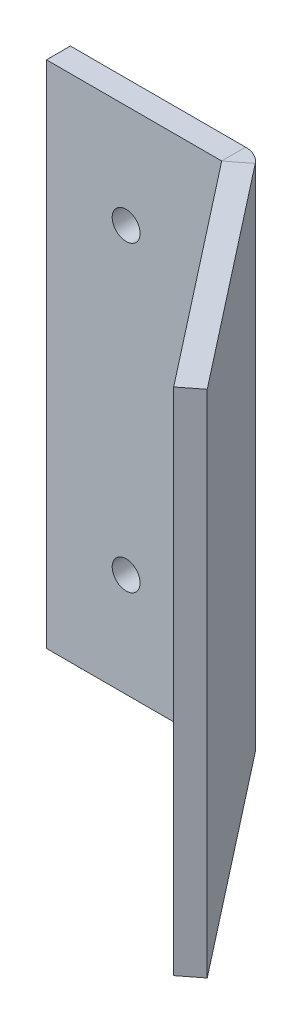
ISO-10303-21;
HEADER;
FILE_DESCRIPTION(('STEP AP214'),'2;1');
FILE_NAME('part.step','',(''),(''),'','','');
FILE_SCHEMA(('AUTOMOTIVE_DESIGN { 1 0 10303 214 1 1 1 1 }'));
ENDSEC;
DATA;
#1=APPLICATION_CONTEXT('core data for automotive mechanical design processes');
#2=APPLICATION_PROTOCOL_DEFINITION('international standard','automotive_design',2000,#1);
#3=PRODUCT_CONTEXT('',#1,'mechanical');
#4=PRODUCT('Part','Part','',(#3));
#5=PRODUCT_RELATED_PRODUCT_CATEGORY('part','',(#4));
#6=PRODUCT_DEFINITION_FORMATION('','',#4);
#7=PRODUCT_DEFINITION_CONTEXT('part definition',#1,'design');
#8=PRODUCT_DEFINITION('design','',#6,#7);
#9=PRODUCT_DEFINITION_SHAPE('','',#8);
#10=(LENGTH_UNIT() NAMED_UNIT(*) SI_UNIT(.MILLI.,.METRE.));
#11=(NAMED_UNIT(*) PLANE_ANGLE_UNIT() SI_UNIT($,.RADIAN.));
#12=(NAMED_UNIT(*) SI_UNIT($,.STERADIAN.) SOLID_ANGLE_UNIT());
#13=UNCERTAINTY_MEASURE_WITH_UNIT(LENGTH_MEASURE(1.E-05),#10,'distance_accuracy_value','');
#14=(GEOMETRIC_REPRESENTATION_CONTEXT(3) GLOBAL_UNCERTAINTY_ASSIGNED_CONTEXT((#13)) GLOBAL_UNIT_ASSIGNED_CONTEXT((#10,
#11,#12)) REPRESENTATION_CONTEXT('',''));
#15=CARTESIAN_POINT('',(0.,0.,0.));
#16=DIRECTION('',(0.,0.,1.));
#17=DIRECTION('',(1.,0.,0.));
#18=AXIS2_PLACEMENT_3D('',#15,#16,#17);
#19=CARTESIAN_POINT('',(8.45597401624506,64.,-14.3359798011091));
#20=DIRECTION('',(0.,-1.,0.));
#21=DIRECTION('',(0.788010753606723,0.,-0.615661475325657));
#22=AXIS2_PLACEMENT_3D('',#19,#20,#21);
#23=PLANE('',#22);
#24=DIRECTION('',(-0.615661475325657,0.,-0.788010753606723));
#25=VECTOR('',#24,1.);
#26=CARTESIAN_POINT('',(10.8200062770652,64.,-16.1829642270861));
#27=LINE('',#26,#25);
#28=CARTESIAN_POINT('',(45.9127103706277,64.,28.7336487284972));
#29=VERTEX_POINT('',#28);
#30=CARTESIAN_POINT('',(24.3673608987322,64.,1.15685895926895));
#31=VERTEX_POINT('',#30);
#32=EDGE_CURVE('E85',#29,#31,#27,.T.);
#33=ORIENTED_EDGE('',*,*,#32,.T.);
#34=DIRECTION('',(-0.788010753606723,0.,0.615661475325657));
#35=VECTOR('',#34,1.);
#36=CARTESIAN_POINT('',(22.0033286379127,64.,3.00384338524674));
#37=LINE('',#36,#35);
#38=CARTESIAN_POINT('',(22.0033286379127,64.,3.00384338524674));
#39=VERTEX_POINT('',#38);
#40=EDGE_CURVE('E100',#31,#39,#37,.T.);
#41=ORIENTED_EDGE('',*,*,#40,.T.);
#42=DIRECTION('',(-0.615661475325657,0.,-0.788010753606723));
#43=VECTOR('',#42,1.);
#44=CARTESIAN_POINT('',(8.45597401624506,64.,-14.3359798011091));
#45=LINE('',#44,#43);
#46=CARTESIAN_POINT('',(43.5486781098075,64.,30.5806331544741));
#47=VERTEX_POINT('',#46);
#48=EDGE_CURVE('E41',#47,#39,#45,.T.);
#49=ORIENTED_EDGE('',*,*,#48,.F.);
#50=DIRECTION('',(0.788010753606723,0.,-0.615661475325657));
#51=VECTOR('',#50,1.);
#52=CARTESIAN_POINT('',(43.5486781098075,64.,30.5806331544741));
#53=LINE('',#52,#51);
#54=EDGE_CURVE('E78',#47,#29,#53,.T.);
#55=ORIENTED_EDGE('',*,*,#54,.T.);
#56=EDGE_LOOP('',(#33,#41,#49,#55));
#57=FACE_BOUND('',#56,.T.);
#58=ADVANCED_FACE('F37',(#57),#23,.F.);
#59=CARTESIAN_POINT('',(8.45597401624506,0.,-14.3359798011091));
#60=DIRECTION('',(0.,1.,0.));
#61=DIRECTION('',(-0.788010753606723,0.,0.615661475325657));
#62=AXIS2_PLACEMENT_3D('',#59,#60,#61);
#63=PLANE('',#62);
#64=DIRECTION('',(0.615661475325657,0.,0.788010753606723));
#65=VECTOR('',#64,1.);
#66=CARTESIAN_POINT('',(8.45597401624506,0.,-14.3359798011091));
#67=LINE('',#66,#65);
#68=CARTESIAN_POINT('',(22.0033286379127,0.,3.00384338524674));
#69=VERTEX_POINT('',#68);
#70=CARTESIAN_POINT('',(43.5486781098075,0.,30.5806331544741));
#71=VERTEX_POINT('',#70);
#72=EDGE_CURVE('E94',#69,#71,#67,.T.);
#73=ORIENTED_EDGE('',*,*,#72,.F.);
#74=DIRECTION('',(0.788010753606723,0.,-0.615661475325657));
#75=VECTOR('',#74,1.);
#76=CARTESIAN_POINT('',(22.0033286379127,0.,3.00384338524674));
#77=LINE('',#76,#75);
#78=CARTESIAN_POINT('',(24.3673608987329,0.,1.15685895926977));
#79=VERTEX_POINT('',#78);
#80=EDGE_CURVE('E12',#69,#79,#77,.T.);
#81=ORIENTED_EDGE('',*,*,#80,.T.);
#82=DIRECTION('',(0.615661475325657,0.,0.788010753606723));
#83=VECTOR('',#82,1.);
#84=CARTESIAN_POINT('',(10.8200062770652,0.,-16.1829642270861));
#85=LINE('',#84,#83);
#86=CARTESIAN_POINT('',(45.9127103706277,0.,28.7336487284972));
#87=VERTEX_POINT('',#86);
#88=EDGE_CURVE('E86',#79,#87,#85,.T.);
#89=ORIENTED_EDGE('',*,*,#88,.T.);
#90=DIRECTION('',(0.788010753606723,0.,-0.615661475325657));
#91=VECTOR('',#90,1.);
#92=CARTESIAN_POINT('',(43.5486781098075,0.,30.5806331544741));
#93=LINE('',#92,#91);
#94=EDGE_CURVE('E81',#71,#87,#93,.T.);
#95=ORIENTED_EDGE('',*,*,#94,.F.);
#96=EDGE_LOOP('',(#73,#81,#89,#95));
#97=FACE_BOUND('',#96,.T.);
#98=ADVANCED_FACE('F39',(#97),#63,.F.);
#99=CARTESIAN_POINT('',(8.45597401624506,64.,-14.3359798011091));
#100=DIRECTION('',(0.788010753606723,0.,-0.615661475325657));
#101=DIRECTION('',(-0.615661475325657,0.,-0.788010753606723));
#102=AXIS2_PLACEMENT_3D('',#99,#100,#101);
#103=PLANE('',#102);
#104=ORIENTED_EDGE('',*,*,#48,.T.);
#105=DIRECTION('',(0.,-1.,0.));
#106=VECTOR('',#105,1.);
#107=CARTESIAN_POINT('',(22.0033286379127,64.,3.00384338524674));
#108=LINE('',#107,#106);
#109=EDGE_CURVE('E102',#39,#69,#108,.T.);
#110=ORIENTED_EDGE('',*,*,#109,.T.);
#111=ORIENTED_EDGE('',*,*,#72,.T.);
#112=DIRECTION('',(0.,1.,0.));
#113=VECTOR('',#112,1.);
#114=CARTESIAN_POINT('',(43.5486781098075,0.,30.5806331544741));
#115=LINE('',#114,#113);
#116=EDGE_CURVE('E62',#71,#47,#115,.T.);
#117=ORIENTED_EDGE('',*,*,#116,.T.);
#118=EDGE_LOOP('',(#104,#110,#111,#117));
#119=FACE_BOUND('',#118,.T.);
#120=ADVANCED_FACE('F234',(#119),#103,.F.);
#121=CARTESIAN_POINT('',(10.8200062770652,64.,-16.1829642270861));
#122=DIRECTION('',(0.788010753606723,0.,-0.615661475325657));
#123=DIRECTION('',(-0.615661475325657,0.,-0.788010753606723));
#124=AXIS2_PLACEMENT_3D('',#121,#122,#123);
#125=PLANE('',#124);
#126=DIRECTION('',(0.,-1.,0.));
#127=VECTOR('',#126,1.);
#128=CARTESIAN_POINT('',(24.3673608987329,64.,1.15685895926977));
#129=LINE('',#128,#127);
#130=EDGE_CURVE('E46',#31,#79,#129,.T.);
#131=ORIENTED_EDGE('',*,*,#130,.F.);
#132=ORIENTED_EDGE('',*,*,#32,.F.);
#133=DIRECTION('',(0.,1.,0.));
#134=VECTOR('',#133,1.);
#135=CARTESIAN_POINT('',(45.9127103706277,0.,28.7336487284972));
#136=LINE('',#135,#134);
#137=EDGE_CURVE('E75',#87,#29,#136,.T.);
#138=ORIENTED_EDGE('',*,*,#137,.F.);
#139=ORIENTED_EDGE('',*,*,#88,.F.);
#140=EDGE_LOOP('',(#131,#132,#138,#139));
#141=FACE_BOUND('',#140,.T.);
#142=ADVANCED_FACE('F93',(#141),#125,.T.);
#143=CARTESIAN_POINT('',(43.5486781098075,0.,30.5806331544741));
#144=DIRECTION('',(-0.615661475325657,0.,-0.788010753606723));
#145=DIRECTION('',(-0.788010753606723,0.,0.615661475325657));
#146=AXIS2_PLACEMENT_3D('',#143,#144,#145);
#147=PLANE('',#146);
#148=ORIENTED_EDGE('',*,*,#137,.T.);
#149=ORIENTED_EDGE('',*,*,#54,.F.);
#150=ORIENTED_EDGE('',*,*,#116,.F.);
#151=ORIENTED_EDGE('',*,*,#94,.T.);
#152=EDGE_LOOP('',(#148,#149,#150,#151));
#153=FACE_BOUND('',#152,.T.);
#154=ADVANCED_FACE('F77',(#153),#147,.F.);
#155=CARTESIAN_POINT('',(10.,13.,3.));
#156=DIRECTION('',(0.,0.,-1.));
#157=DIRECTION('',(-1.,0.,0.));
#158=AXIS2_PLACEMENT_3D('',#155,#156,#157);
#159=CYLINDRICAL_SURFACE('',#158,1.75);
#160=CARTESIAN_POINT('',(10.,13.,3.));
#161=DIRECTION('',(0.,0.,1.));
#162=DIRECTION('',(1.,0.,0.));
#163=AXIS2_PLACEMENT_3D('',#160,#161,#162);
#164=CIRCLE('',#163,1.75);
#165=CARTESIAN_POINT('',(11.75,13.,3.));
#166=VERTEX_POINT('',#165);
#167=EDGE_CURVE('E117',#166,#166,#164,.T.);
#168=ORIENTED_EDGE('',*,*,#167,.T.);
#169=EDGE_LOOP('',(#168));
#170=FACE_BOUND('',#169,.T.);
#171=CARTESIAN_POINT('',(10.,13.,0.));
#172=DIRECTION('',(0.,0.,1.));
#173=DIRECTION('',(1.,0.,0.));
#174=AXIS2_PLACEMENT_3D('',#171,#172,#173);
#175=CIRCLE('',#174,1.75);
#176=CARTESIAN_POINT('',(11.75,13.,0.));
#177=VERTEX_POINT('',#176);
#178=EDGE_CURVE('E144',#177,#177,#175,.T.);
#179=ORIENTED_EDGE('',*,*,#178,.F.);
#180=EDGE_LOOP('',(#179));
#181=FACE_BOUND('',#180,.T.);
#182=ADVANCED_FACE('F226',(#170,#181),#159,.F.);
#183=CARTESIAN_POINT('',(9.99999999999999,51.,3.));
#184=DIRECTION('',(0.,0.,-1.));
#185=DIRECTION('',(-1.,0.,0.));
#186=AXIS2_PLACEMENT_3D('',#183,#184,#185);
#187=CYLINDRICAL_SURFACE('',#186,1.75);
#188=CARTESIAN_POINT('',(9.99999999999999,51.,3.));
#189=DIRECTION('',(0.,0.,1.));
#190=DIRECTION('',(1.,0.,0.));
#191=AXIS2_PLACEMENT_3D('',#188,#189,#190);
#192=CIRCLE('',#191,1.75);
#193=CARTESIAN_POINT('',(11.75,51.,3.));
#194=VERTEX_POINT('',#193);
#195=EDGE_CURVE('E120',#194,#194,#192,.T.);
#196=ORIENTED_EDGE('',*,*,#195,.T.);
#197=EDGE_LOOP('',(#196));
#198=FACE_BOUND('',#197,.T.);
#199=CARTESIAN_POINT('',(9.99999999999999,51.,0.));
#200=DIRECTION('',(0.,0.,1.));
#201=DIRECTION('',(1.,0.,0.));
#202=AXIS2_PLACEMENT_3D('',#199,#200,#201);
#203=CIRCLE('',#202,1.75);
#204=CARTESIAN_POINT('',(11.75,51.,0.));
#205=VERTEX_POINT('',#204);
#206=EDGE_CURVE('E141',#205,#205,#203,.T.);
#207=ORIENTED_EDGE('',*,*,#206,.F.);
#208=EDGE_LOOP('',(#207));
#209=FACE_BOUND('',#208,.T.);
#210=ADVANCED_FACE('F219',(#198,#209),#187,.F.);
#211=CARTESIAN_POINT('',(0.,0.,3.));
#212=DIRECTION('',(1.,0.,0.));
#213=DIRECTION('',(0.,0.,-1.));
#214=AXIS2_PLACEMENT_3D('',#211,#212,#213);
#215=PLANE('',#214);
#216=DIRECTION('',(0.,-1.,0.));
#217=VECTOR('',#216,1.);
#218=CARTESIAN_POINT('',(0.,0.,0.));
#219=LINE('',#218,#217);
#220=CARTESIAN_POINT('',(0.,64.,0.));
#221=VERTEX_POINT('',#220);
#222=CARTESIAN_POINT('',(0.,0.,0.));
#223=VERTEX_POINT('',#222);
#224=EDGE_CURVE('E123',#221,#223,#219,.T.);
#225=ORIENTED_EDGE('',*,*,#224,.T.);
#226=DIRECTION('',(0.,0.,-1.));
#227=VECTOR('',#226,1.);
#228=CARTESIAN_POINT('',(0.,0.,3.));
#229=LINE('',#228,#227);
#230=CARTESIAN_POINT('',(0.,0.,3.));
#231=VERTEX_POINT('',#230);
#232=EDGE_CURVE('E150',#231,#223,#229,.T.);
#233=ORIENTED_EDGE('',*,*,#232,.F.);
#234=DIRECTION('',(0.,-1.,0.));
#235=VECTOR('',#234,1.);
#236=CARTESIAN_POINT('',(0.,0.,3.));
#237=LINE('',#236,#235);
#238=CARTESIAN_POINT('',(0.,64.,3.));
#239=VERTEX_POINT('',#238);
#240=EDGE_CURVE('E132',#239,#231,#237,.T.);
#241=ORIENTED_EDGE('',*,*,#240,.F.);
#242=DIRECTION('',(0.,0.,-1.));
#243=VECTOR('',#242,1.);
#244=CARTESIAN_POINT('',(0.,64.,3.));
#245=LINE('',#244,#243);
#246=EDGE_CURVE('E126',#239,#221,#245,.T.);
#247=ORIENTED_EDGE('',*,*,#246,.T.);
#248=EDGE_LOOP('',(#225,#233,#241,#247));
#249=FACE_BOUND('',#248,.T.);
#250=ADVANCED_FACE('F217',(#249),#215,.F.);
#251=CARTESIAN_POINT('',(0.,64.,3.));
#252=DIRECTION('',(0.,0.,-1.));
#253=DIRECTION('',(-1.,0.,0.));
#254=AXIS2_PLACEMENT_3D('',#251,#252,#253);
#255=PLANE('',#254);
#256=DIRECTION('',(0.,-1.,0.));
#257=VECTOR('',#256,1.);
#258=CARTESIAN_POINT('',(21.9954485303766,64.,3.));
#259=LINE('',#258,#257);
#260=CARTESIAN_POINT('',(21.9954485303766,64.,3.));
#261=VERTEX_POINT('',#260);
#262=CARTESIAN_POINT('',(21.9954485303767,0.,3.));
#263=VERTEX_POINT('',#262);
#264=EDGE_CURVE('E107',#261,#263,#259,.T.);
#265=ORIENTED_EDGE('',*,*,#264,.F.);
#266=DIRECTION('',(-1.,0.,0.));
#267=VECTOR('',#266,1.);
#268=CARTESIAN_POINT('',(0.,64.,3.));
#269=LINE('',#268,#267);
#270=EDGE_CURVE('E129',#261,#239,#269,.T.);
#271=ORIENTED_EDGE('',*,*,#270,.T.);
#272=ORIENTED_EDGE('',*,*,#240,.T.);
#273=DIRECTION('',(1.,0.,0.));
#274=VECTOR('',#273,1.);
#275=CARTESIAN_POINT('',(0.,0.,3.));
#276=LINE('',#275,#274);
#277=EDGE_CURVE('E135',#231,#263,#276,.T.);
#278=ORIENTED_EDGE('',*,*,#277,.T.);
#279=EDGE_LOOP('',(#265,#271,#272,#278));
#280=FACE_BOUND('',#279,.T.);
#281=ORIENTED_EDGE('',*,*,#195,.F.);
#282=EDGE_LOOP('',(#281));
#283=FACE_BOUND('',#282,.T.);
#284=ORIENTED_EDGE('',*,*,#167,.F.);
#285=EDGE_LOOP('',(#284));
#286=FACE_BOUND('',#285,.T.);
#287=ADVANCED_FACE('F200',(#280,#283,#286),#255,.F.);
#288=CARTESIAN_POINT('',(0.,64.,3.));
#289=DIRECTION('',(0.,-1.,0.));
#290=DIRECTION('',(0.,0.,-1.));
#291=AXIS2_PLACEMENT_3D('',#288,#289,#290);
#292=PLANE('',#291);
#293=DIRECTION('',(0.,0.,1.));
#294=VECTOR('',#293,1.);
#295=CARTESIAN_POINT('',(21.9954485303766,64.,3.));
#296=LINE('',#295,#294);
#297=CARTESIAN_POINT('',(21.9954485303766,64.,0.));
#298=VERTEX_POINT('',#297);
#299=EDGE_CURVE('E114',#298,#261,#296,.T.);
#300=ORIENTED_EDGE('',*,*,#299,.F.);
#301=DIRECTION('',(-1.,0.,0.));
#302=VECTOR('',#301,1.);
#303=CARTESIAN_POINT('',(0.,64.,0.));
#304=LINE('',#303,#302);
#305=EDGE_CURVE('E138',#298,#221,#304,.T.);
#306=ORIENTED_EDGE('',*,*,#305,.T.);
#307=ORIENTED_EDGE('',*,*,#246,.F.);
#308=ORIENTED_EDGE('',*,*,#270,.F.);
#309=EDGE_LOOP('',(#300,#306,#307,#308));
#310=FACE_BOUND('',#309,.T.);
#311=ADVANCED_FACE('F215',(#310),#292,.F.);
#312=CARTESIAN_POINT('',(0.,64.,0.));
#313=DIRECTION('',(0.,0.,-1.));
#314=DIRECTION('',(-1.,0.,0.));
#315=AXIS2_PLACEMENT_3D('',#312,#313,#314);
#316=PLANE('',#315);
#317=ORIENTED_EDGE('',*,*,#206,.T.);
#318=EDGE_LOOP('',(#317));
#319=FACE_BOUND('',#318,.T.);
#320=ORIENTED_EDGE('',*,*,#178,.T.);
#321=EDGE_LOOP('',(#320));
#322=FACE_BOUND('',#321,.T.);
#323=ORIENTED_EDGE('',*,*,#305,.F.);
#324=DIRECTION('',(0.,-1.,0.));
#325=VECTOR('',#324,1.);
#326=CARTESIAN_POINT('',(21.9954485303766,64.,0.));
#327=LINE('',#326,#325);
#328=CARTESIAN_POINT('',(21.9954485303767,0.,0.));
#329=VERTEX_POINT('',#328);
#330=EDGE_CURVE('E147',#298,#329,#327,.T.);
#331=ORIENTED_EDGE('',*,*,#330,.T.);
#332=DIRECTION('',(1.,0.,0.));
#333=VECTOR('',#332,1.);
#334=CARTESIAN_POINT('',(0.,0.,0.));
#335=LINE('',#334,#333);
#336=EDGE_CURVE('E97',#223,#329,#335,.T.);
#337=ORIENTED_EDGE('',*,*,#336,.F.);
#338=ORIENTED_EDGE('',*,*,#224,.F.);
#339=EDGE_LOOP('',(#323,#331,#337,#338));
#340=FACE_BOUND('',#339,.T.);
#341=ADVANCED_FACE('F211',(#319,#322,#340),#316,.T.);
#342=CARTESIAN_POINT('',(0.,0.,3.));
#343=DIRECTION('',(0.,1.,0.));
#344=DIRECTION('',(0.,0.,1.));
#345=AXIS2_PLACEMENT_3D('',#342,#343,#344);
#346=PLANE('',#345);
#347=DIRECTION('',(0.,0.,-1.));
#348=VECTOR('',#347,1.);
#349=CARTESIAN_POINT('',(21.9954485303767,0.,3.));
#350=LINE('',#349,#348);
#351=EDGE_CURVE('E110',#263,#329,#350,.T.);
#352=ORIENTED_EDGE('',*,*,#351,.F.);
#353=ORIENTED_EDGE('',*,*,#277,.F.);
#354=ORIENTED_EDGE('',*,*,#232,.T.);
#355=ORIENTED_EDGE('',*,*,#336,.T.);
#356=EDGE_LOOP('',(#352,#353,#354,#355));
#357=FACE_BOUND('',#356,.T.);
#358=ADVANCED_FACE('F205',(#357),#346,.F.);
#359=CARTESIAN_POINT('',(21.9954485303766,64.,3.01));
#360=DIRECTION('',(0.,-1.,0.));
#361=DIRECTION('',(0.,0.,-1.));
#362=AXIS2_PLACEMENT_3D('',#359,#360,#361);
#363=PLANE('',#362);
#364=ORIENTED_EDGE('',*,*,#40,.F.);
#365=CARTESIAN_POINT('',(21.9954485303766,64.,3.01));
#366=DIRECTION('',(0.,1.,0.));
#367=DIRECTION('',(-1.,0.,0.));
#368=AXIS2_PLACEMENT_3D('',#365,#366,#367);
#369=CIRCLE('',#368,3.01);
#370=EDGE_CURVE('E155',#31,#298,#369,.T.);
#371=ORIENTED_EDGE('',*,*,#370,.T.);
#372=ORIENTED_EDGE('',*,*,#299,.T.);
#373=CARTESIAN_POINT('',(21.9954485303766,64.,3.01));
#374=DIRECTION('',(0.,1.,0.));
#375=DIRECTION('',(0.,0.,1.));
#376=AXIS2_PLACEMENT_3D('',#373,#374,#375);
#377=CIRCLE('',#376,0.0100000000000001);
#378=EDGE_CURVE('E160',#39,#261,#377,.T.);
#379=ORIENTED_EDGE('',*,*,#378,.F.);
#380=EDGE_LOOP('',(#364,#371,#372,#379));
#381=FACE_BOUND('',#380,.T.);
#382=ADVANCED_FACE('F178',(#381),#363,.F.);
#383=CARTESIAN_POINT('',(21.9954485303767,0.,3.01));
#384=DIRECTION('',(0.,1.,0.));
#385=DIRECTION('',(-1.,0.,0.));
#386=AXIS2_PLACEMENT_3D('',#383,#384,#385);
#387=PLANE('',#386);
#388=ORIENTED_EDGE('',*,*,#351,.T.);
#389=CARTESIAN_POINT('',(21.9954485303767,0.,3.01));
#390=DIRECTION('',(0.,1.,0.));
#391=DIRECTION('',(-1.,0.,0.));
#392=AXIS2_PLACEMENT_3D('',#389,#390,#391);
#393=CIRCLE('',#392,3.01);
#394=EDGE_CURVE('E158',#329,#79,#393,.F.);
#395=ORIENTED_EDGE('',*,*,#394,.T.);
#396=ORIENTED_EDGE('',*,*,#80,.F.);
#397=CARTESIAN_POINT('',(21.9954485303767,0.,3.01));
#398=DIRECTION('',(0.,-1.,0.));
#399=DIRECTION('',(1.,0.,0.));
#400=AXIS2_PLACEMENT_3D('',#397,#398,#399);
#401=CIRCLE('',#400,0.0100000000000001);
#402=EDGE_CURVE('E111',#263,#69,#401,.T.);
#403=ORIENTED_EDGE('',*,*,#402,.F.);
#404=EDGE_LOOP('',(#388,#395,#396,#403));
#405=FACE_BOUND('',#404,.T.);
#406=ADVANCED_FACE('F207',(#405),#387,.F.);
#407=CARTESIAN_POINT('',(21.9954485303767,-32.0702745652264,3.01));
#408=DIRECTION('',(0.,1.,0.));
#409=DIRECTION('',(-1.,0.,0.));
#410=AXIS2_PLACEMENT_3D('',#407,#408,#409);
#411=CYLINDRICAL_SURFACE('',#410,0.01);
#412=ORIENTED_EDGE('',*,*,#402,.T.);
#413=ORIENTED_EDGE('',*,*,#109,.F.);
#414=ORIENTED_EDGE('',*,*,#378,.T.);
#415=ORIENTED_EDGE('',*,*,#264,.T.);
#416=EDGE_LOOP('',(#412,#413,#414,#415));
#417=FACE_BOUND('',#416,.T.);
#418=ADVANCED_FACE('F168',(#417),#411,.F.);
#419=CARTESIAN_POINT('',(21.9954485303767,-32.0702745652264,3.01));
#420=DIRECTION('',(0.,1.,0.));
#421=DIRECTION('',(-1.,0.,0.));
#422=AXIS2_PLACEMENT_3D('',#419,#420,#421);
#423=CYLINDRICAL_SURFACE('',#422,3.01);
#424=ORIENTED_EDGE('',*,*,#394,.F.);
#425=ORIENTED_EDGE('',*,*,#330,.F.);
#426=ORIENTED_EDGE('',*,*,#370,.F.);
#427=ORIENTED_EDGE('',*,*,#130,.T.);
#428=EDGE_LOOP('',(#424,#425,#426,#427));
#429=FACE_BOUND('',#428,.T.);
#430=ADVANCED_FACE('F209',(#429),#423,.T.);
#431=CLOSED_SHELL('',(#58,#98,#120,#142,#154,#182,#210,#250,#287,#311,#341,#358,#382,#406,#418,#430));
#432=MANIFOLD_SOLID_BREP('B2',#431);
#433=ADVANCED_BREP_SHAPE_REPRESENTATION('',(#18,#432),#14);
#434=SHAPE_DEFINITION_REPRESENTATION(#9,#433);
ENDSEC;
END-ISO-10303-21;
